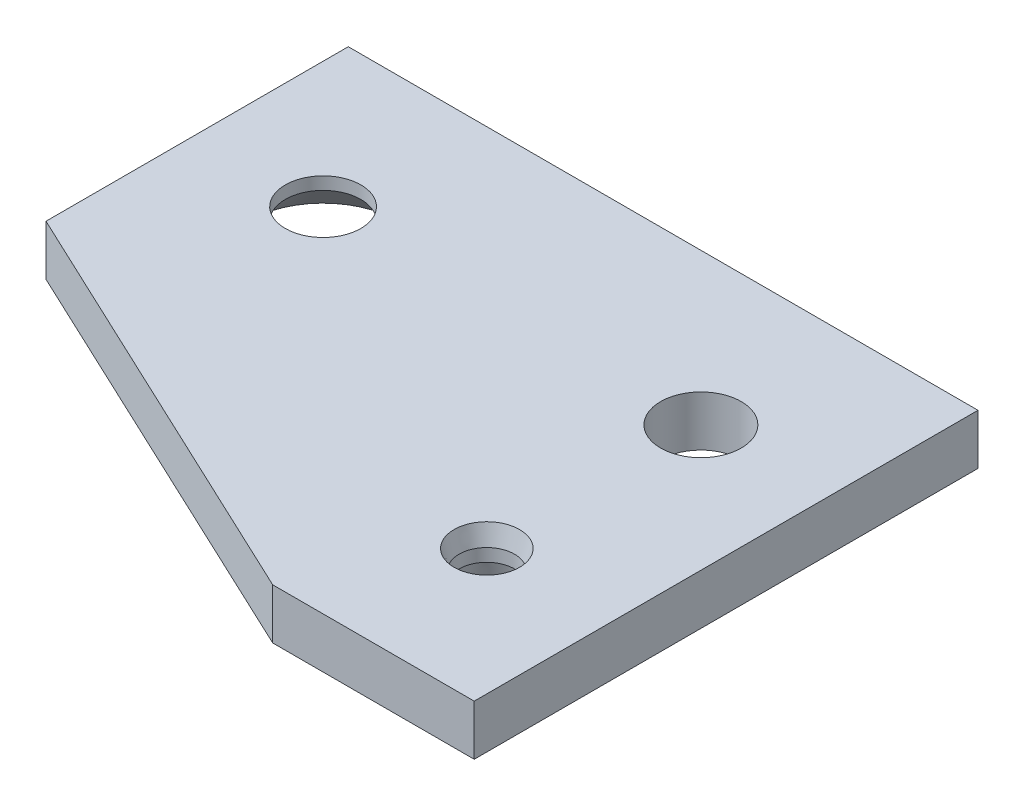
from build123d import *
from OCP.BRepFilletAPI import BRepFilletAPI_MakeChamfer

# Parameters (mm, degrees)
SKETCH1_R      = 1.6
SKETCH1_R_2    = 1.5
SKETCH1_R_3    = 1.1
EXTRUDE1_DEPTH = 2
CHAMFER1_SIZE  = 1.5
CHAMFER2_SIZE  = 0.2
CHAMFER2_SIZE2 = 0.746410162


with BuildPart() as part:
    # Sketch1 → Extrude1 (new body)
    with BuildSketch(Plane(origin=(0, 0, 0), x_dir=(1, 0, 0), z_dir=(0, 1, 0))):
        Polygon((-20, 6), (5, 6), (5, -14), (-3, -14), (-20, -6), align=None)
        with Locations(Location((0, 0, 0), (0, 0, 270))):
            Circle(SKETCH1_R, mode=Mode.SUBTRACT)
        with Locations(Location((-15, 0, 0), (0, 0, 270))):
            Circle(SKETCH1_R_2, mode=Mode.SUBTRACT)
        with Locations(Location((0, -8.5, 0), (0, 0, 270))):
            Circle(SKETCH1_R_3, mode=Mode.SUBTRACT)
    extrude(amount=EXTRUDE1_DEPTH)

    # Chamfer1
    chamfer1_edges = [part.edges().sort_by_distance(p)[0] for p in [
        (-15, 0, -1.5),
    ]]
    chamfer(chamfer1_edges, length=CHAMFER1_SIZE)

    # Chamfer2: one chamfer whose edges measure the first distance from different faces: ONE call of the kernel's chamfer builder (chamfer() names one face for all edges)
    chamfer2_edges_1 = [part.edges().sort_by_distance(p)[0] for p in [
        (0, 0, 7.4),
    ]]
    chamfer2_side_1 = [part.faces().sort_by_distance(p)[0] for p in [
        (-5.999814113, 0, 3.054548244),
    ]]
    chamfer2_edges_2 = [part.edges().sort_by_distance(p)[0] for p in [
        (0, 2, 7.4),
    ]]
    chamfer2_side_2 = [part.faces().sort_by_distance(p)[0] for p in [
        (-6.46183643, 2, 2.897743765),
    ]]
    chamfer2 = BRepFilletAPI_MakeChamfer(part.part.solid().wrapped)
    for e in chamfer2_edges_1:
        chamfer2.Add(CHAMFER2_SIZE, CHAMFER2_SIZE2, e.wrapped, chamfer2_side_1[0].wrapped)  # the first distance lies on this face
    for e in chamfer2_edges_2:
        chamfer2.Add(CHAMFER2_SIZE, CHAMFER2_SIZE2, e.wrapped, chamfer2_side_2[0].wrapped)  # the first distance lies on this face
    add(Compound.cast(chamfer2.Shape()), mode=Mode.REPLACE)


solid = part.part
